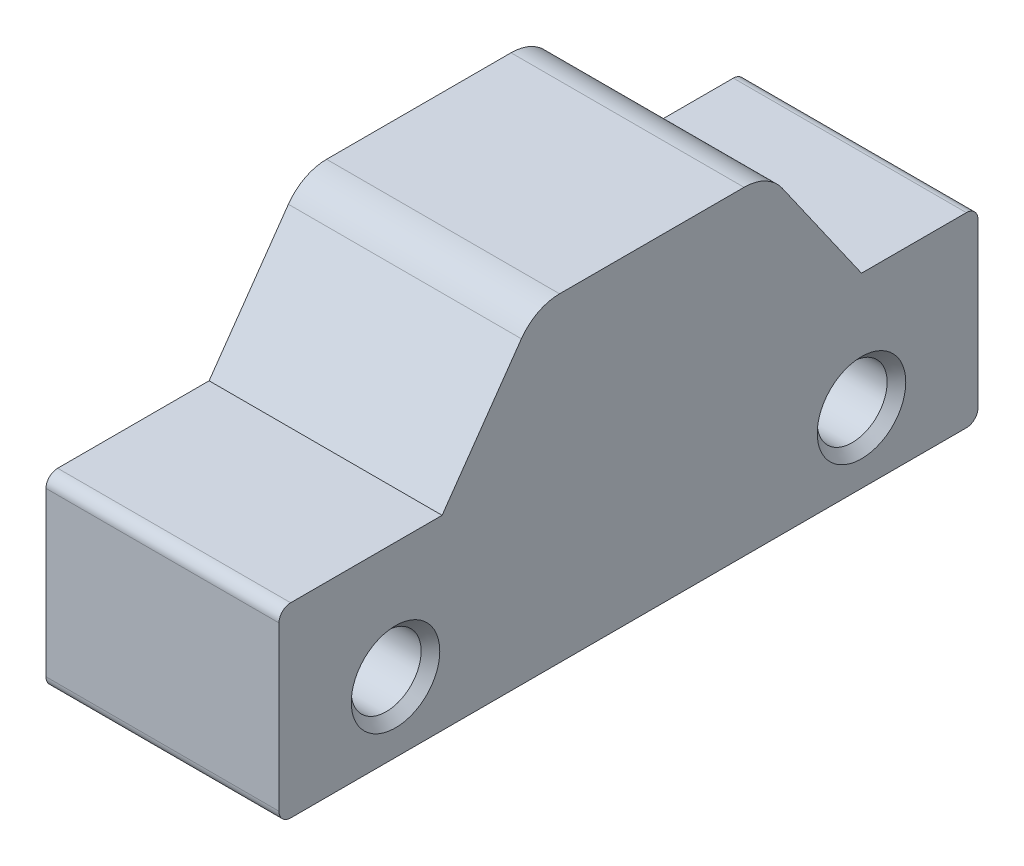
ISO-10303-21;
HEADER;
FILE_DESCRIPTION(('STEP AP214'),'2;1');
FILE_NAME('part.step','',(''),(''),'','','');
FILE_SCHEMA(('AUTOMOTIVE_DESIGN { 1 0 10303 214 1 1 1 1 }'));
ENDSEC;
DATA;
#1=APPLICATION_CONTEXT('core data for automotive mechanical design processes');
#2=APPLICATION_PROTOCOL_DEFINITION('international standard','automotive_design',2000,#1);
#3=PRODUCT_CONTEXT('',#1,'mechanical');
#4=PRODUCT('Part','Part','',(#3));
#5=PRODUCT_RELATED_PRODUCT_CATEGORY('part','',(#4));
#6=PRODUCT_DEFINITION_FORMATION('','',#4);
#7=PRODUCT_DEFINITION_CONTEXT('part definition',#1,'design');
#8=PRODUCT_DEFINITION('design','',#6,#7);
#9=PRODUCT_DEFINITION_SHAPE('','',#8);
#10=(LENGTH_UNIT() NAMED_UNIT(*) SI_UNIT(.MILLI.,.METRE.));
#11=(NAMED_UNIT(*) PLANE_ANGLE_UNIT() SI_UNIT($,.RADIAN.));
#12=(NAMED_UNIT(*) SI_UNIT($,.STERADIAN.) SOLID_ANGLE_UNIT());
#13=UNCERTAINTY_MEASURE_WITH_UNIT(LENGTH_MEASURE(1.E-05),#10,'distance_accuracy_value','');
#14=(GEOMETRIC_REPRESENTATION_CONTEXT(3) GLOBAL_UNCERTAINTY_ASSIGNED_CONTEXT((#13)) GLOBAL_UNIT_ASSIGNED_CONTEXT((#10,
#11,#12)) REPRESENTATION_CONTEXT('',''));
#15=CARTESIAN_POINT('',(0.,0.,0.));
#16=DIRECTION('',(0.,0.,1.));
#17=DIRECTION('',(1.,0.,0.));
#18=AXIS2_PLACEMENT_3D('',#15,#16,#17);
#19=CARTESIAN_POINT('',(25.,40.,40.));
#20=DIRECTION('',(0.,-1.,0.));
#21=DIRECTION('',(0.,0.,-1.));
#22=AXIS2_PLACEMENT_3D('',#19,#20,#21);
#23=PLANE('',#22);
#24=DIRECTION('',(0.,0.,1.));
#25=VECTOR('',#24,1.);
#26=CARTESIAN_POINT('',(-25.,40.,40.));
#27=LINE('',#26,#25);
#28=CARTESIAN_POINT('',(-25.,40.,40.));
#29=VERTEX_POINT('',#28);
#30=CARTESIAN_POINT('',(-25.,40.,72.5));
#31=VERTEX_POINT('',#30);
#32=EDGE_CURVE('E282',#29,#31,#27,.T.);
#33=ORIENTED_EDGE('',*,*,#32,.T.);
#34=DIRECTION('',(-1.,0.,0.));
#35=VECTOR('',#34,1.);
#36=CARTESIAN_POINT('',(25.,40.,72.5));
#37=LINE('',#36,#35);
#38=CARTESIAN_POINT('',(25.,40.,72.5));
#39=VERTEX_POINT('',#38);
#40=EDGE_CURVE('E13',#31,#39,#37,.F.);
#41=ORIENTED_EDGE('',*,*,#40,.T.);
#42=DIRECTION('',(0.,0.,1.));
#43=VECTOR('',#42,1.);
#44=CARTESIAN_POINT('',(25.,40.,40.));
#45=LINE('',#44,#43);
#46=CARTESIAN_POINT('',(25.,40.,40.));
#47=VERTEX_POINT('',#46);
#48=EDGE_CURVE('E264',#47,#39,#45,.T.);
#49=ORIENTED_EDGE('',*,*,#48,.F.);
#50=DIRECTION('',(-1.,0.,0.));
#51=VECTOR('',#50,1.);
#52=CARTESIAN_POINT('',(25.,40.,40.));
#53=LINE('',#52,#51);
#54=EDGE_CURVE('E173',#47,#29,#53,.T.);
#55=ORIENTED_EDGE('',*,*,#54,.T.);
#56=EDGE_LOOP('',(#33,#41,#49,#55));
#57=FACE_BOUND('',#56,.T.);
#58=ADVANCED_FACE('F46',(#57),#23,.F.);
#59=CARTESIAN_POINT('',(25.,40.,75.));
#60=DIRECTION('',(0.,0.,-1.));
#61=DIRECTION('',(0.,1.,0.));
#62=AXIS2_PLACEMENT_3D('',#59,#60,#61);
#63=PLANE('',#62);
#64=DIRECTION('',(0.,-1.,0.));
#65=VECTOR('',#64,1.);
#66=CARTESIAN_POINT('',(-25.,40.,75.));
#67=LINE('',#66,#65);
#68=CARTESIAN_POINT('',(-25.,37.5,75.));
#69=VERTEX_POINT('',#68);
#70=CARTESIAN_POINT('',(-25.,2.5,75.));
#71=VERTEX_POINT('',#70);
#72=EDGE_CURVE('E285',#69,#71,#67,.T.);
#73=ORIENTED_EDGE('',*,*,#72,.T.);
#74=DIRECTION('',(-1.,0.,0.));
#75=VECTOR('',#74,1.);
#76=CARTESIAN_POINT('',(25.,2.5,75.));
#77=LINE('',#76,#75);
#78=CARTESIAN_POINT('',(25.,2.5,75.));
#79=VERTEX_POINT('',#78);
#80=EDGE_CURVE('E69',#71,#79,#77,.F.);
#81=ORIENTED_EDGE('',*,*,#80,.T.);
#82=DIRECTION('',(0.,-1.,0.));
#83=VECTOR('',#82,1.);
#84=CARTESIAN_POINT('',(25.,40.,75.));
#85=LINE('',#84,#83);
#86=CARTESIAN_POINT('',(25.,37.5,75.));
#87=VERTEX_POINT('',#86);
#88=EDGE_CURVE('E268',#87,#79,#85,.T.);
#89=ORIENTED_EDGE('',*,*,#88,.F.);
#90=DIRECTION('',(-1.,0.,0.));
#91=VECTOR('',#90,1.);
#92=CARTESIAN_POINT('',(25.,37.5,75.));
#93=LINE('',#92,#91);
#94=EDGE_CURVE('E244',#87,#69,#93,.T.);
#95=ORIENTED_EDGE('',*,*,#94,.T.);
#96=EDGE_LOOP('',(#73,#81,#89,#95));
#97=FACE_BOUND('',#96,.T.);
#98=ADVANCED_FACE('F312',(#97),#63,.F.);
#99=CARTESIAN_POINT('',(25.,0.,75.));
#100=DIRECTION('',(0.,1.,0.));
#101=DIRECTION('',(0.,0.,1.));
#102=AXIS2_PLACEMENT_3D('',#99,#100,#101);
#103=PLANE('',#102);
#104=DIRECTION('',(0.,0.,-1.));
#105=VECTOR('',#104,1.);
#106=CARTESIAN_POINT('',(-25.,0.,75.));
#107=LINE('',#106,#105);
#108=CARTESIAN_POINT('',(-25.,0.,72.5));
#109=VERTEX_POINT('',#108);
#110=CARTESIAN_POINT('',(-25.,0.,-72.5));
#111=VERTEX_POINT('',#110);
#112=EDGE_CURVE('E257',#109,#111,#107,.T.);
#113=ORIENTED_EDGE('',*,*,#112,.T.);
#114=DIRECTION('',(-1.,0.,0.));
#115=VECTOR('',#114,1.);
#116=CARTESIAN_POINT('',(25.,0.,-72.5));
#117=LINE('',#116,#115);
#118=CARTESIAN_POINT('',(25.,0.,-72.5));
#119=VERTEX_POINT('',#118);
#120=EDGE_CURVE('E235',#111,#119,#117,.F.);
#121=ORIENTED_EDGE('',*,*,#120,.T.);
#122=DIRECTION('',(0.,0.,-1.));
#123=VECTOR('',#122,1.);
#124=CARTESIAN_POINT('',(25.,0.,75.));
#125=LINE('',#124,#123);
#126=CARTESIAN_POINT('',(25.,0.,72.5));
#127=VERTEX_POINT('',#126);
#128=EDGE_CURVE('E273',#127,#119,#125,.T.);
#129=ORIENTED_EDGE('',*,*,#128,.F.);
#130=DIRECTION('',(-1.,0.,0.));
#131=VECTOR('',#130,1.);
#132=CARTESIAN_POINT('',(25.,0.,72.5));
#133=LINE('',#132,#131);
#134=EDGE_CURVE('E232',#127,#109,#133,.T.);
#135=ORIENTED_EDGE('',*,*,#134,.T.);
#136=EDGE_LOOP('',(#113,#121,#129,#135));
#137=FACE_BOUND('',#136,.T.);
#138=ADVANCED_FACE('F290',(#137),#103,.F.);
#139=CARTESIAN_POINT('',(25.,0.,-75.));
#140=DIRECTION('',(0.,0.,1.));
#141=DIRECTION('',(0.,-1.,0.));
#142=AXIS2_PLACEMENT_3D('',#139,#140,#141);
#143=PLANE('',#142);
#144=DIRECTION('',(0.,1.,0.));
#145=VECTOR('',#144,1.);
#146=CARTESIAN_POINT('',(25.,0.,-75.));
#147=LINE('',#146,#145);
#148=CARTESIAN_POINT('',(25.,2.50000000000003,-75.));
#149=VERTEX_POINT('',#148);
#150=CARTESIAN_POINT('',(25.,37.5,-75.));
#151=VERTEX_POINT('',#150);
#152=EDGE_CURVE('E157',#149,#151,#147,.T.);
#153=ORIENTED_EDGE('',*,*,#152,.F.);
#154=DIRECTION('',(-1.,0.,0.));
#155=VECTOR('',#154,1.);
#156=CARTESIAN_POINT('',(25.,2.50000000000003,-75.));
#157=LINE('',#156,#155);
#158=CARTESIAN_POINT('',(-25.,2.50000000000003,-75.));
#159=VERTEX_POINT('',#158);
#160=EDGE_CURVE('E221',#149,#159,#157,.T.);
#161=ORIENTED_EDGE('',*,*,#160,.T.);
#162=DIRECTION('',(0.,1.,0.));
#163=VECTOR('',#162,1.);
#164=CARTESIAN_POINT('',(-25.,0.,-75.));
#165=LINE('',#164,#163);
#166=CARTESIAN_POINT('',(-25.,37.5,-75.));
#167=VERTEX_POINT('',#166);
#168=EDGE_CURVE('E253',#159,#167,#165,.T.);
#169=ORIENTED_EDGE('',*,*,#168,.T.);
#170=DIRECTION('',(-1.,0.,0.));
#171=VECTOR('',#170,1.);
#172=CARTESIAN_POINT('',(25.,37.5,-75.));
#173=LINE('',#172,#171);
#174=EDGE_CURVE('E219',#167,#151,#173,.F.);
#175=ORIENTED_EDGE('',*,*,#174,.T.);
#176=EDGE_LOOP('',(#153,#161,#169,#175));
#177=FACE_BOUND('',#176,.T.);
#178=ADVANCED_FACE('F299',(#177),#143,.F.);
#179=CARTESIAN_POINT('',(25.,40.,-75.));
#180=DIRECTION('',(0.,-1.,0.));
#181=DIRECTION('',(0.,0.,-1.));
#182=AXIS2_PLACEMENT_3D('',#179,#180,#181);
#183=PLANE('',#182);
#184=DIRECTION('',(0.,0.,1.));
#185=VECTOR('',#184,1.);
#186=CARTESIAN_POINT('',(25.,40.,-75.));
#187=LINE('',#186,#185);
#188=CARTESIAN_POINT('',(25.,40.,-72.5));
#189=VERTEX_POINT('',#188);
#190=CARTESIAN_POINT('',(25.,40.,-50.));
#191=VERTEX_POINT('',#190);
#192=EDGE_CURVE('E147',#189,#191,#187,.T.);
#193=ORIENTED_EDGE('',*,*,#192,.F.);
#194=DIRECTION('',(-1.,0.,0.));
#195=VECTOR('',#194,1.);
#196=CARTESIAN_POINT('',(25.,40.,-72.5));
#197=LINE('',#196,#195);
#198=CARTESIAN_POINT('',(-25.,40.,-72.5));
#199=VERTEX_POINT('',#198);
#200=EDGE_CURVE('E54',#189,#199,#197,.T.);
#201=ORIENTED_EDGE('',*,*,#200,.T.);
#202=DIRECTION('',(0.,0.,1.));
#203=VECTOR('',#202,1.);
#204=CARTESIAN_POINT('',(-25.,40.,-75.));
#205=LINE('',#204,#203);
#206=CARTESIAN_POINT('',(-25.,40.,-50.));
#207=VERTEX_POINT('',#206);
#208=EDGE_CURVE('E170',#199,#207,#205,.T.);
#209=ORIENTED_EDGE('',*,*,#208,.T.);
#210=DIRECTION('',(-1.,0.,0.));
#211=VECTOR('',#210,1.);
#212=CARTESIAN_POINT('',(25.,40.,-50.));
#213=LINE('',#212,#211);
#214=EDGE_CURVE('E163',#191,#207,#213,.T.);
#215=ORIENTED_EDGE('',*,*,#214,.F.);
#216=EDGE_LOOP('',(#193,#201,#209,#215));
#217=FACE_BOUND('',#216,.T.);
#218=ADVANCED_FACE('F168',(#217),#183,.F.);
#219=CARTESIAN_POINT('',(25.,68.562960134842,-30.));
#220=DIRECTION('',(0.,0.57357643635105,-0.819152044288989));
#221=DIRECTION('',(0.,0.819152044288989,0.57357643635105));
#222=AXIS2_PLACEMENT_3D('',#219,#220,#221);
#223=PLANE('',#222);
#224=DIRECTION('',(0.,-0.819152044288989,-0.57357643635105));
#225=VECTOR('',#224,1.);
#226=CARTESIAN_POINT('',(-25.,68.562960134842,-30.));
#227=LINE('',#226,#225);
#228=CARTESIAN_POINT('',(-25.,64.2987244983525,-32.9858499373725));
#229=VERTEX_POINT('',#228);
#230=EDGE_CURVE('E252',#229,#207,#227,.T.);
#231=ORIENTED_EDGE('',*,*,#230,.F.);
#232=DIRECTION('',(-1.,0.,0.));
#233=VECTOR('',#232,1.);
#234=CARTESIAN_POINT('',(25.,64.2987244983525,-32.9858499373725));
#235=LINE('',#234,#233);
#236=CARTESIAN_POINT('',(25.,64.2987244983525,-32.9858499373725));
#237=VERTEX_POINT('',#236);
#238=EDGE_CURVE('E165',#229,#237,#235,.F.);
#239=ORIENTED_EDGE('',*,*,#238,.T.);
#240=DIRECTION('',(0.,-0.819152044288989,-0.57357643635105));
#241=VECTOR('',#240,1.);
#242=CARTESIAN_POINT('',(25.,68.562960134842,-30.));
#243=LINE('',#242,#241);
#244=EDGE_CURVE('E151',#237,#191,#243,.T.);
#245=ORIENTED_EDGE('',*,*,#244,.T.);
#246=ORIENTED_EDGE('',*,*,#214,.T.);
#247=EDGE_LOOP('',(#231,#239,#245,#246));
#248=FACE_BOUND('',#247,.T.);
#249=ADVANCED_FACE('F162',(#248),#223,.T.);
#250=CARTESIAN_POINT('',(25.,68.562960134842,20.));
#251=DIRECTION('',(0.,1.,0.));
#252=DIRECTION('',(0.,0.,1.));
#253=AXIS2_PLACEMENT_3D('',#250,#251,#252);
#254=PLANE('',#253);
#255=DIRECTION('',(0.,0.,-1.));
#256=VECTOR('',#255,1.);
#257=CARTESIAN_POINT('',(25.,68.562960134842,20.));
#258=LINE('',#257,#256);
#259=CARTESIAN_POINT('',(25.,68.562960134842,14.7943294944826));
#260=VERTEX_POINT('',#259);
#261=CARTESIAN_POINT('',(25.,68.562960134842,-24.7943294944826));
#262=VERTEX_POINT('',#261);
#263=EDGE_CURVE('E166',#260,#262,#258,.T.);
#264=ORIENTED_EDGE('',*,*,#263,.T.);
#265=DIRECTION('',(-1.,0.,0.));
#266=VECTOR('',#265,1.);
#267=CARTESIAN_POINT('',(25.,68.562960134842,-24.7943294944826));
#268=LINE('',#267,#266);
#269=CARTESIAN_POINT('',(-25.,68.562960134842,-24.7943294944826));
#270=VERTEX_POINT('',#269);
#271=EDGE_CURVE('E204',#262,#270,#268,.T.);
#272=ORIENTED_EDGE('',*,*,#271,.T.);
#273=DIRECTION('',(0.,0.,-1.));
#274=VECTOR('',#273,1.);
#275=CARTESIAN_POINT('',(-25.,68.562960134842,20.));
#276=LINE('',#275,#274);
#277=CARTESIAN_POINT('',(-25.,68.562960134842,14.7943294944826));
#278=VERTEX_POINT('',#277);
#279=EDGE_CURVE('E255',#278,#270,#276,.T.);
#280=ORIENTED_EDGE('',*,*,#279,.F.);
#281=DIRECTION('',(-1.,0.,0.));
#282=VECTOR('',#281,1.);
#283=CARTESIAN_POINT('',(25.,68.562960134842,14.7943294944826));
#284=LINE('',#283,#282);
#285=EDGE_CURVE('E202',#278,#260,#284,.F.);
#286=ORIENTED_EDGE('',*,*,#285,.T.);
#287=EDGE_LOOP('',(#264,#272,#280,#286));
#288=FACE_BOUND('',#287,.T.);
#289=ADVANCED_FACE('F442',(#288),#254,.T.);
#290=CARTESIAN_POINT('',(25.,40.,40.));
#291=DIRECTION('',(0.,0.57357643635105,0.819152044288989));
#292=DIRECTION('',(0.,-0.819152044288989,0.57357643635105));
#293=AXIS2_PLACEMENT_3D('',#290,#291,#292);
#294=PLANE('',#293);
#295=DIRECTION('',(0.,0.819152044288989,-0.57357643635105));
#296=VECTOR('',#295,1.);
#297=CARTESIAN_POINT('',(25.,40.,40.));
#298=LINE('',#297,#296);
#299=CARTESIAN_POINT('',(25.,64.2987244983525,22.9858499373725));
#300=VERTEX_POINT('',#299);
#301=EDGE_CURVE('E178',#47,#300,#298,.T.);
#302=ORIENTED_EDGE('',*,*,#301,.T.);
#303=DIRECTION('',(-1.,0.,0.));
#304=VECTOR('',#303,1.);
#305=CARTESIAN_POINT('',(25.,64.2987244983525,22.9858499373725));
#306=LINE('',#305,#304);
#307=CARTESIAN_POINT('',(-25.,64.2987244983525,22.9858499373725));
#308=VERTEX_POINT('',#307);
#309=EDGE_CURVE('E216',#300,#308,#306,.T.);
#310=ORIENTED_EDGE('',*,*,#309,.T.);
#311=DIRECTION('',(0.,0.819152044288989,-0.57357643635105));
#312=VECTOR('',#311,1.);
#313=CARTESIAN_POINT('',(-25.,40.,40.));
#314=LINE('',#313,#312);
#315=EDGE_CURVE('E262',#29,#308,#314,.T.);
#316=ORIENTED_EDGE('',*,*,#315,.F.);
#317=ORIENTED_EDGE('',*,*,#54,.F.);
#318=EDGE_LOOP('',(#302,#310,#316,#317));
#319=FACE_BOUND('',#318,.T.);
#320=ADVANCED_FACE('F433',(#319),#294,.T.);
#321=CARTESIAN_POINT('',(25.,0.,0.));
#322=DIRECTION('',(1.,0.,0.));
#323=DIRECTION('',(0.,0.,-1.));
#324=AXIS2_PLACEMENT_3D('',#321,#322,#323);
#325=PLANE('',#324);
#326=CARTESIAN_POINT('',(25.,15.,-50.));
#327=DIRECTION('',(1.,0.,0.));
#328=DIRECTION('',(0.,0.,-1.));
#329=AXIS2_PLACEMENT_3D('',#326,#327,#328);
#330=CIRCLE('',#329,9.49999999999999);
#331=CARTESIAN_POINT('',(25.,15.,-59.5));
#332=VERTEX_POINT('',#331);
#333=EDGE_CURVE('E199',#332,#332,#330,.F.);
#334=ORIENTED_EDGE('',*,*,#333,.T.);
#335=EDGE_LOOP('',(#334));
#336=FACE_BOUND('',#335,.T.);
#337=CARTESIAN_POINT('',(25.,15.,50.));
#338=DIRECTION('',(1.,0.,0.));
#339=DIRECTION('',(0.,0.,-1.));
#340=AXIS2_PLACEMENT_3D('',#337,#338,#339);
#341=CIRCLE('',#340,9.49999999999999);
#342=CARTESIAN_POINT('',(25.,15.,40.5));
#343=VERTEX_POINT('',#342);
#344=EDGE_CURVE('E187',#343,#343,#341,.F.);
#345=ORIENTED_EDGE('',*,*,#344,.T.);
#346=EDGE_LOOP('',(#345));
#347=FACE_BOUND('',#346,.T.);
#348=ORIENTED_EDGE('',*,*,#128,.T.);
#349=CARTESIAN_POINT('',(25.,2.50000000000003,-72.5));
#350=DIRECTION('',(1.,0.,0.));
#351=DIRECTION('',(0.,0.,-1.));
#352=AXIS2_PLACEMENT_3D('',#349,#350,#351);
#353=CIRCLE('',#352,2.5);
#354=EDGE_CURVE('E242',#119,#149,#353,.T.);
#355=ORIENTED_EDGE('',*,*,#354,.T.);
#356=ORIENTED_EDGE('',*,*,#152,.T.);
#357=CARTESIAN_POINT('',(25.,37.5,-72.5));
#358=DIRECTION('',(1.,0.,0.));
#359=DIRECTION('',(0.,0.,-1.));
#360=AXIS2_PLACEMENT_3D('',#357,#358,#359);
#361=CIRCLE('',#360,2.5);
#362=EDGE_CURVE('E61',#151,#189,#361,.T.);
#363=ORIENTED_EDGE('',*,*,#362,.T.);
#364=ORIENTED_EDGE('',*,*,#192,.T.);
#365=ORIENTED_EDGE('',*,*,#244,.F.);
#366=CARTESIAN_POINT('',(25.,58.562960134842,-24.7943294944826));
#367=DIRECTION('',(1.,0.,0.));
#368=DIRECTION('',(0.,0.,-1.));
#369=AXIS2_PLACEMENT_3D('',#366,#367,#368);
#370=CIRCLE('',#369,10.);
#371=EDGE_CURVE('E214',#237,#262,#370,.T.);
#372=ORIENTED_EDGE('',*,*,#371,.T.);
#373=ORIENTED_EDGE('',*,*,#263,.F.);
#374=CARTESIAN_POINT('',(25.,58.562960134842,14.7943294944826));
#375=DIRECTION('',(1.,0.,0.));
#376=DIRECTION('',(0.,0.,-1.));
#377=AXIS2_PLACEMENT_3D('',#374,#375,#376);
#378=CIRCLE('',#377,10.);
#379=EDGE_CURVE('E212',#260,#300,#378,.T.);
#380=ORIENTED_EDGE('',*,*,#379,.T.);
#381=ORIENTED_EDGE('',*,*,#301,.F.);
#382=ORIENTED_EDGE('',*,*,#48,.T.);
#383=CARTESIAN_POINT('',(25.,37.5,72.5));
#384=DIRECTION('',(1.,0.,0.));
#385=DIRECTION('',(0.,0.,-1.));
#386=AXIS2_PLACEMENT_3D('',#383,#384,#385);
#387=CIRCLE('',#386,2.5);
#388=EDGE_CURVE('E237',#39,#87,#387,.T.);
#389=ORIENTED_EDGE('',*,*,#388,.T.);
#390=ORIENTED_EDGE('',*,*,#88,.T.);
#391=CARTESIAN_POINT('',(25.,2.5,72.5));
#392=DIRECTION('',(1.,0.,0.));
#393=DIRECTION('',(0.,0.,-1.));
#394=AXIS2_PLACEMENT_3D('',#391,#392,#393);
#395=CIRCLE('',#394,2.5);
#396=EDGE_CURVE('E240',#79,#127,#395,.T.);
#397=ORIENTED_EDGE('',*,*,#396,.T.);
#398=EDGE_LOOP('',(#348,#355,#356,#363,#364,#365,#372,#373,#380,#381,#382,#389,#390,#397));
#399=FACE_BOUND('',#398,.T.);
#400=ADVANCED_FACE('F150',(#336,#347,#399),#325,.T.);
#401=CARTESIAN_POINT('',(-25.,0.,0.));
#402=DIRECTION('',(1.,0.,0.));
#403=DIRECTION('',(0.,0.,-1.));
#404=AXIS2_PLACEMENT_3D('',#401,#402,#403);
#405=PLANE('',#404);
#406=CARTESIAN_POINT('',(-25.,15.,-50.));
#407=DIRECTION('',(1.,0.,0.));
#408=DIRECTION('',(0.,0.,-1.));
#409=AXIS2_PLACEMENT_3D('',#406,#407,#408);
#410=CIRCLE('',#409,9.49999999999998);
#411=CARTESIAN_POINT('',(-25.,15.,-59.5));
#412=VERTEX_POINT('',#411);
#413=EDGE_CURVE('E190',#412,#412,#410,.T.);
#414=ORIENTED_EDGE('',*,*,#413,.T.);
#415=EDGE_LOOP('',(#414));
#416=FACE_BOUND('',#415,.T.);
#417=CARTESIAN_POINT('',(-25.,15.,50.));
#418=DIRECTION('',(1.,0.,0.));
#419=DIRECTION('',(0.,0.,-1.));
#420=AXIS2_PLACEMENT_3D('',#417,#418,#419);
#421=CIRCLE('',#420,9.49999999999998);
#422=CARTESIAN_POINT('',(-25.,15.,40.5));
#423=VERTEX_POINT('',#422);
#424=EDGE_CURVE('E172',#423,#423,#421,.T.);
#425=ORIENTED_EDGE('',*,*,#424,.T.);
#426=EDGE_LOOP('',(#425));
#427=FACE_BOUND('',#426,.T.);
#428=ORIENTED_EDGE('',*,*,#168,.F.);
#429=CARTESIAN_POINT('',(-25.,2.50000000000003,-72.5));
#430=DIRECTION('',(1.,0.,0.));
#431=DIRECTION('',(0.,0.,-1.));
#432=AXIS2_PLACEMENT_3D('',#429,#430,#431);
#433=CIRCLE('',#432,2.5);
#434=EDGE_CURVE('E230',#159,#111,#433,.F.);
#435=ORIENTED_EDGE('',*,*,#434,.T.);
#436=ORIENTED_EDGE('',*,*,#112,.F.);
#437=CARTESIAN_POINT('',(-25.,2.5,72.5));
#438=DIRECTION('',(1.,0.,0.));
#439=DIRECTION('',(0.,0.,-1.));
#440=AXIS2_PLACEMENT_3D('',#437,#438,#439);
#441=CIRCLE('',#440,2.5);
#442=EDGE_CURVE('E228',#109,#71,#441,.F.);
#443=ORIENTED_EDGE('',*,*,#442,.T.);
#444=ORIENTED_EDGE('',*,*,#72,.F.);
#445=CARTESIAN_POINT('',(-25.,37.5,72.5));
#446=DIRECTION('',(1.,0.,0.));
#447=DIRECTION('',(0.,0.,-1.));
#448=AXIS2_PLACEMENT_3D('',#445,#446,#447);
#449=CIRCLE('',#448,2.5);
#450=EDGE_CURVE('E224',#69,#31,#449,.F.);
#451=ORIENTED_EDGE('',*,*,#450,.T.);
#452=ORIENTED_EDGE('',*,*,#32,.F.);
#453=ORIENTED_EDGE('',*,*,#315,.T.);
#454=CARTESIAN_POINT('',(-25.,58.562960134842,14.7943294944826));
#455=DIRECTION('',(1.,0.,0.));
#456=DIRECTION('',(0.,0.,-1.));
#457=AXIS2_PLACEMENT_3D('',#454,#455,#456);
#458=CIRCLE('',#457,10.);
#459=EDGE_CURVE('E207',#308,#278,#458,.F.);
#460=ORIENTED_EDGE('',*,*,#459,.T.);
#461=ORIENTED_EDGE('',*,*,#279,.T.);
#462=CARTESIAN_POINT('',(-25.,58.562960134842,-24.7943294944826));
#463=DIRECTION('',(1.,0.,0.));
#464=DIRECTION('',(0.,0.,-1.));
#465=AXIS2_PLACEMENT_3D('',#462,#463,#464);
#466=CIRCLE('',#465,10.);
#467=EDGE_CURVE('E209',#270,#229,#466,.F.);
#468=ORIENTED_EDGE('',*,*,#467,.T.);
#469=ORIENTED_EDGE('',*,*,#230,.T.);
#470=ORIENTED_EDGE('',*,*,#208,.F.);
#471=CARTESIAN_POINT('',(-25.,37.5,-72.5));
#472=DIRECTION('',(1.,0.,0.));
#473=DIRECTION('',(0.,0.,-1.));
#474=AXIS2_PLACEMENT_3D('',#471,#472,#473);
#475=CIRCLE('',#474,2.5);
#476=EDGE_CURVE('E226',#199,#167,#475,.F.);
#477=ORIENTED_EDGE('',*,*,#476,.T.);
#478=EDGE_LOOP('',(#428,#435,#436,#443,#444,#451,#452,#453,#460,#461,#468,#469,#470,#477));
#479=FACE_BOUND('',#478,.T.);
#480=ADVANCED_FACE('F250',(#416,#427,#479),#405,.F.);
#481=CARTESIAN_POINT('',(-25.,15.,50.));
#482=DIRECTION('',(1.,0.,0.));
#483=DIRECTION('',(0.,0.,-1.));
#484=AXIS2_PLACEMENT_3D('',#481,#482,#483);
#485=CYLINDRICAL_SURFACE('',#484,7.5);
#486=CARTESIAN_POINT('',(-23.,15.,50.));
#487=DIRECTION('',(1.,0.,0.));
#488=DIRECTION('',(0.,0.,-1.));
#489=AXIS2_PLACEMENT_3D('',#486,#487,#488);
#490=CIRCLE('',#489,7.5);
#491=CARTESIAN_POINT('',(-23.,15.,42.5));
#492=VERTEX_POINT('',#491);
#493=EDGE_CURVE('E184',#492,#492,#490,.F.);
#494=ORIENTED_EDGE('',*,*,#493,.T.);
#495=EDGE_LOOP('',(#494));
#496=FACE_BOUND('',#495,.T.);
#497=CARTESIAN_POINT('',(23.,15.,50.));
#498=DIRECTION('',(1.,0.,0.));
#499=DIRECTION('',(0.,0.,-1.));
#500=AXIS2_PLACEMENT_3D('',#497,#498,#499);
#501=CIRCLE('',#500,7.5);
#502=CARTESIAN_POINT('',(23.,15.,42.5));
#503=VERTEX_POINT('',#502);
#504=EDGE_CURVE('E176',#503,#503,#501,.T.);
#505=ORIENTED_EDGE('',*,*,#504,.T.);
#506=EDGE_LOOP('',(#505));
#507=FACE_BOUND('',#506,.T.);
#508=ADVANCED_FACE('F325',(#496,#507),#485,.F.);
#509=CARTESIAN_POINT('',(-25.,15.,50.));
#510=DIRECTION('',(-1.,0.,0.));
#511=DIRECTION('',(0.,0.,1.));
#512=AXIS2_PLACEMENT_3D('',#509,#510,#511);
#513=CONICAL_SURFACE('',#512,9.49999999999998,0.785398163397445);
#514=ORIENTED_EDGE('',*,*,#493,.F.);
#515=EDGE_LOOP('',(#514));
#516=FACE_BOUND('',#515,.T.);
#517=ORIENTED_EDGE('',*,*,#424,.F.);
#518=EDGE_LOOP('',(#517));
#519=FACE_BOUND('',#518,.T.);
#520=ADVANCED_FACE('F321',(#516,#519),#513,.F.);
#521=CARTESIAN_POINT('',(23.,15.,50.));
#522=DIRECTION('',(1.,0.,0.));
#523=DIRECTION('',(0.,0.,-1.));
#524=AXIS2_PLACEMENT_3D('',#521,#522,#523);
#525=CONICAL_SURFACE('',#524,7.5,0.785398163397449);
#526=ORIENTED_EDGE('',*,*,#344,.F.);
#527=EDGE_LOOP('',(#526));
#528=FACE_BOUND('',#527,.T.);
#529=ORIENTED_EDGE('',*,*,#504,.F.);
#530=EDGE_LOOP('',(#529));
#531=FACE_BOUND('',#530,.T.);
#532=ADVANCED_FACE('F324',(#528,#531),#525,.F.);
#533=CARTESIAN_POINT('',(-25.,15.,-50.));
#534=DIRECTION('',(1.,0.,0.));
#535=DIRECTION('',(0.,0.,-1.));
#536=AXIS2_PLACEMENT_3D('',#533,#534,#535);
#537=CYLINDRICAL_SURFACE('',#536,7.5);
#538=CARTESIAN_POINT('',(-23.,15.,-50.));
#539=DIRECTION('',(1.,0.,0.));
#540=DIRECTION('',(0.,0.,-1.));
#541=AXIS2_PLACEMENT_3D('',#538,#539,#540);
#542=CIRCLE('',#541,7.5);
#543=CARTESIAN_POINT('',(-23.,15.,-57.5));
#544=VERTEX_POINT('',#543);
#545=EDGE_CURVE('E196',#544,#544,#542,.F.);
#546=ORIENTED_EDGE('',*,*,#545,.T.);
#547=EDGE_LOOP('',(#546));
#548=FACE_BOUND('',#547,.T.);
#549=CARTESIAN_POINT('',(23.,15.,-50.));
#550=DIRECTION('',(1.,0.,0.));
#551=DIRECTION('',(0.,0.,-1.));
#552=AXIS2_PLACEMENT_3D('',#549,#550,#551);
#553=CIRCLE('',#552,7.5);
#554=CARTESIAN_POINT('',(23.,15.,-57.5));
#555=VERTEX_POINT('',#554);
#556=EDGE_CURVE('E193',#555,#555,#553,.T.);
#557=ORIENTED_EDGE('',*,*,#556,.T.);
#558=EDGE_LOOP('',(#557));
#559=FACE_BOUND('',#558,.T.);
#560=ADVANCED_FACE('F329',(#548,#559),#537,.F.);
#561=CARTESIAN_POINT('',(-25.,15.,-50.));
#562=DIRECTION('',(-1.,0.,0.));
#563=DIRECTION('',(0.,0.,1.));
#564=AXIS2_PLACEMENT_3D('',#561,#562,#563);
#565=CONICAL_SURFACE('',#564,9.49999999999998,0.785398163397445);
#566=ORIENTED_EDGE('',*,*,#545,.F.);
#567=EDGE_LOOP('',(#566));
#568=FACE_BOUND('',#567,.T.);
#569=ORIENTED_EDGE('',*,*,#413,.F.);
#570=EDGE_LOOP('',(#569));
#571=FACE_BOUND('',#570,.T.);
#572=ADVANCED_FACE('F331',(#568,#571),#565,.F.);
#573=CARTESIAN_POINT('',(23.,15.,-50.));
#574=DIRECTION('',(1.,0.,0.));
#575=DIRECTION('',(0.,0.,-1.));
#576=AXIS2_PLACEMENT_3D('',#573,#574,#575);
#577=CONICAL_SURFACE('',#576,7.5,0.785398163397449);
#578=ORIENTED_EDGE('',*,*,#333,.F.);
#579=EDGE_LOOP('',(#578));
#580=FACE_BOUND('',#579,.T.);
#581=ORIENTED_EDGE('',*,*,#556,.F.);
#582=EDGE_LOOP('',(#581));
#583=FACE_BOUND('',#582,.T.);
#584=ADVANCED_FACE('F334',(#580,#583),#577,.F.);
#585=CARTESIAN_POINT('',(25.,58.562960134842,-24.7943294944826));
#586=DIRECTION('',(-1.,0.,0.));
#587=DIRECTION('',(0.,0.,1.));
#588=AXIS2_PLACEMENT_3D('',#585,#586,#587);
#589=CYLINDRICAL_SURFACE('',#588,10.);
#590=ORIENTED_EDGE('',*,*,#371,.F.);
#591=ORIENTED_EDGE('',*,*,#238,.F.);
#592=ORIENTED_EDGE('',*,*,#467,.F.);
#593=ORIENTED_EDGE('',*,*,#271,.F.);
#594=EDGE_LOOP('',(#590,#591,#592,#593));
#595=FACE_BOUND('',#594,.T.);
#596=ADVANCED_FACE('F338',(#595),#589,.T.);
#597=CARTESIAN_POINT('',(25.,58.562960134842,14.7943294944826));
#598=DIRECTION('',(-1.,0.,0.));
#599=DIRECTION('',(0.,0.,1.));
#600=AXIS2_PLACEMENT_3D('',#597,#598,#599);
#601=CYLINDRICAL_SURFACE('',#600,10.);
#602=ORIENTED_EDGE('',*,*,#379,.F.);
#603=ORIENTED_EDGE('',*,*,#285,.F.);
#604=ORIENTED_EDGE('',*,*,#459,.F.);
#605=ORIENTED_EDGE('',*,*,#309,.F.);
#606=EDGE_LOOP('',(#602,#603,#604,#605));
#607=FACE_BOUND('',#606,.T.);
#608=ADVANCED_FACE('F342',(#607),#601,.T.);
#609=CARTESIAN_POINT('',(25.,2.50000000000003,-72.5));
#610=DIRECTION('',(-1.,0.,0.));
#611=DIRECTION('',(0.,0.,1.));
#612=AXIS2_PLACEMENT_3D('',#609,#610,#611);
#613=CYLINDRICAL_SURFACE('',#612,2.5);
#614=ORIENTED_EDGE('',*,*,#354,.F.);
#615=ORIENTED_EDGE('',*,*,#120,.F.);
#616=ORIENTED_EDGE('',*,*,#434,.F.);
#617=ORIENTED_EDGE('',*,*,#160,.F.);
#618=EDGE_LOOP('',(#614,#615,#616,#617));
#619=FACE_BOUND('',#618,.T.);
#620=ADVANCED_FACE('F295',(#619),#613,.T.);
#621=CARTESIAN_POINT('',(25.,2.5,72.5));
#622=DIRECTION('',(-1.,0.,0.));
#623=DIRECTION('',(0.,0.,1.));
#624=AXIS2_PLACEMENT_3D('',#621,#622,#623);
#625=CYLINDRICAL_SURFACE('',#624,2.5);
#626=ORIENTED_EDGE('',*,*,#396,.F.);
#627=ORIENTED_EDGE('',*,*,#80,.F.);
#628=ORIENTED_EDGE('',*,*,#442,.F.);
#629=ORIENTED_EDGE('',*,*,#134,.F.);
#630=EDGE_LOOP('',(#626,#627,#628,#629));
#631=FACE_BOUND('',#630,.T.);
#632=ADVANCED_FACE('F303',(#631),#625,.T.);
#633=CARTESIAN_POINT('',(25.,37.5,-72.5));
#634=DIRECTION('',(-1.,0.,0.));
#635=DIRECTION('',(0.,0.,1.));
#636=AXIS2_PLACEMENT_3D('',#633,#634,#635);
#637=CYLINDRICAL_SURFACE('',#636,2.5);
#638=ORIENTED_EDGE('',*,*,#362,.F.);
#639=ORIENTED_EDGE('',*,*,#174,.F.);
#640=ORIENTED_EDGE('',*,*,#476,.F.);
#641=ORIENTED_EDGE('',*,*,#200,.F.);
#642=EDGE_LOOP('',(#638,#639,#640,#641));
#643=FACE_BOUND('',#642,.T.);
#644=ADVANCED_FACE('F301',(#643),#637,.T.);
#645=CARTESIAN_POINT('',(25.,37.5,72.5));
#646=DIRECTION('',(-1.,0.,0.));
#647=DIRECTION('',(0.,0.,1.));
#648=AXIS2_PLACEMENT_3D('',#645,#646,#647);
#649=CYLINDRICAL_SURFACE('',#648,2.5);
#650=ORIENTED_EDGE('',*,*,#388,.F.);
#651=ORIENTED_EDGE('',*,*,#40,.F.);
#652=ORIENTED_EDGE('',*,*,#450,.F.);
#653=ORIENTED_EDGE('',*,*,#94,.F.);
#654=EDGE_LOOP('',(#650,#651,#652,#653));
#655=FACE_BOUND('',#654,.T.);
#656=ADVANCED_FACE('F48',(#655),#649,.T.);
#657=CLOSED_SHELL('',(#58,#98,#138,#178,#218,#249,#289,#320,#400,#480,#508,#520,#532,#560,#572,
#584,#596,#608,#620,#632,#644,#656));
#658=MANIFOLD_SOLID_BREP('B2',#657);
#659=ADVANCED_BREP_SHAPE_REPRESENTATION('',(#18,#658),#14);
#660=SHAPE_DEFINITION_REPRESENTATION(#9,#659);
ENDSEC;
END-ISO-10303-21;
